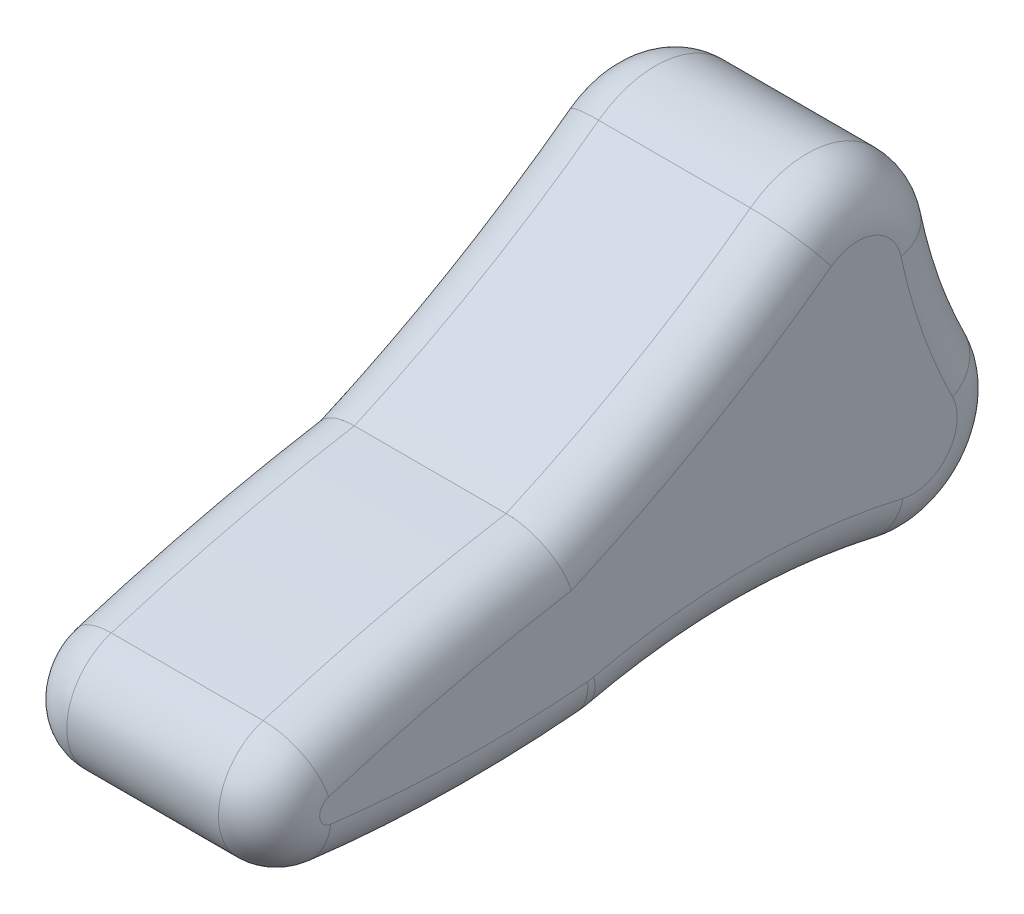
from build123d import *

# Parameters (mm, degrees)
BASE_EXTRUDE_DEPTH  = 50.8
BOSS_EXTRUDE1_DEPTH = 50.8
FILLET1_R           = 20.32


with BuildPart() as part:
    # Sketch11 → Base-Extrude (new, symmetric)
    with BuildSketch(Plane(origin=(114.3, 0, 0), x_dir=(0, 0, -1), z_dir=(1, 0, 0))):
        with BuildLine():
            ThreePointArc((63.178221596, -1151.070511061), (39.347988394, -1123.361347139), (3.158238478, -1128.458383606))
            ThreePointArc((3.158238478, -1128.458383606), (-46.274692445, -1160.977570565), (-99.153599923, -1187.528151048))
            ThreePointArc((-99.153599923, -1187.528151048), (-120.263310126, -1234.415407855), (-75.44784558, -1259.626692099))
            ThreePointArc((-75.44784558, -1259.626692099), (-17.970029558, -1253.037889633), (39.507786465, -1259.626692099))
            ThreePointArc((39.507786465, -1259.626692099), (78.039277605, -1246.116129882), (82.218579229, -1205.49908249))
            ThreePointArc((82.218579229, -1205.49908249), (70.97536466, -1178.887554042), (63.178221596, -1151.070511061))
        make_face()
    extrude(amount=BASE_EXTRUDE_DEPTH, both=True)

    # Sketch12 → Boss-Extrude1 (add, symmetric)
    with BuildSketch(Plane(origin=(114.3, 0, 0), x_dir=(0, 0, -1), z_dir=(1, 0, 0))):
        with BuildLine():
            ThreePointArc((-80.767718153, -1260.471673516), (-46.262227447, -1217.801332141), (-90.188533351, -1184.909591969))
            ThreePointArc((-90.188533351, -1184.909591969), (-141.808855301, -1195.150236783), (-192.599237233, -1208.929407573))
            ThreePointArc((-192.599237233, -1208.929407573), (-210.409971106, -1235.407951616), (-188.280650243, -1258.399878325))
            ThreePointArc((-188.280650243, -1258.399878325), (-134.579158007, -1262.288565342), (-80.767718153, -1260.471673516))
        make_face()
    extrude(amount=BOSS_EXTRUDE1_DEPTH, both=True)

    # Fillet1
    fillet1_edges = [part.edges().sort_by_distance(p)[0] for p in [
        (165.1, -1159.833069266, 44.30259242),
        (165.1, -1253.037889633, 17.970029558),
        (63.5, -1260.1433157, 78.092830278),
        (165.1, -1246.116129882, -78.039277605),
        (165.1, -1260.1433157, 78.092830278),
        (165.1, -1195.707854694, 144.169405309),
        (165.1, -1235.407951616, 210.409971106),
        (165.1, -1262.288565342, 134.579158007),
        (63.5, -1195.707854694, 144.169405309),
        (63.5, -1235.407951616, 210.409971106),
        (63.5, -1262.288565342, 134.579158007),
        (165.1, -1178.887554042, -70.97536466),
        (63.5, -1246.116129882, -78.039277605),
        (63.5, -1253.037889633, 17.970029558),
        (165.1, -1123.361347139, -39.347988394),
        (63.5, -1159.833069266, 44.30259242),
        (63.5, -1123.361347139, -39.347988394),
        (63.5, -1178.887554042, -70.97536466),
    ]]
    fillet(fillet1_edges, radius=FILLET1_R)


solid = part.part
